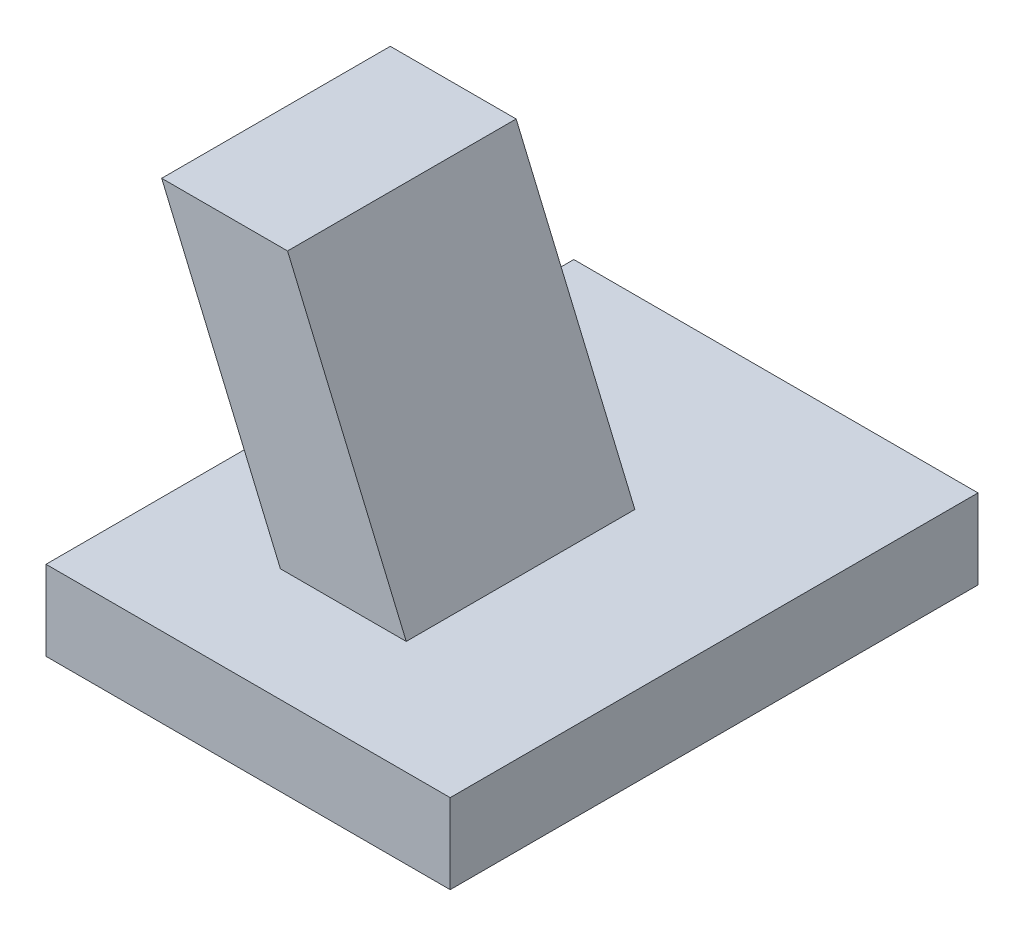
from build123d import *

# Parameters (mm, degrees)
SKETCH1_W           = 101.364890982
SKETCH1_H           = 132.36949937
EXTRUDE1_DEPTH      = 20
SKETCH2_W           = 31.564072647
SKETCH2_H           = 57.331064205
BOSS_EXTRUDE1_DEPTH = 76


with BuildPart() as part:
    # Sketch1 → Extrude1 (new body)
    with BuildSketch(Plane(origin=(0, 0, 0), x_dir=(1, 0, 0), z_dir=(0, 1, 0))):
        Rectangle(SKETCH1_W, SKETCH1_H)
    extrude(amount=EXTRUDE1_DEPTH)

    # Sketch2 → Boss-Extrude1 (add, along a direction that is not the sketch's normal)
    with BuildSketch(Plane(origin=(0, 20, 0), x_dir=(1, 0, 0), z_dir=(0, 1, 0))):
        with Locations((-4.529797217, -9.108579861)):
            Rectangle(SKETCH2_W, SKETCH2_H)
    extrude(amount=BOSS_EXTRUDE1_DEPTH, dir=(-0.39170161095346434, 0.9200923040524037, 0))


solid = part.part
